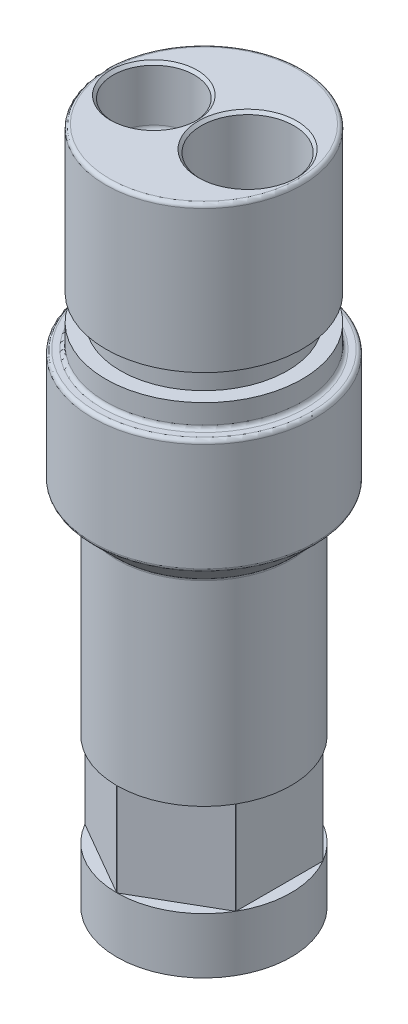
from build123d import *

# Parameters (mm, degrees)
CHAMFER1_SIZE      = 0.381
CUT_EXTRUDE3_START = -7.62
SKETCH6_OUTSIDE_W  = 52.928
SKETCH6_OUTSIDE_H  = 52.928
CUT_EXTRUDE3_DEPTH = 12.7


with BuildPart() as part:
    # Sketch1 → Revolve1 (revolve)
    with BuildSketch(Plane.XY, mode=Mode.PRIVATE) as revolve1_sk:
        with BuildLine():
            Line((-11.9126, 0.508), (-11.9126, 0))
            Line((-11.9126, 0), (-11.1506, 0))
            Line((-11.1506, 0), (-11.1506, 1.27))
            Line((-11.1506, 1.27), (-8.5852, 1.27))
            Line((-8.5852, 1.27), (-8.5852, 0))
            Line((-8.5852, 0), (-6.1341, 0))
            Line((-6.1341, 0), (-6.1341, 3.175))
            Line((-6.1341, 3.175), (-5.7531, 3.403927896))
            Line((-5.7531, 3.403927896), (-5.7531, 66.559453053))
            Line((-5.7531, 66.559453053), (0, 70.01626428))
            Line((0, 70.01626428), (0, 92.71))
            Line((0, 92.71), (-12.92225, 92.71))
            ThreePointArc((-12.92225, 92.71), (-13.281460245, 92.561210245), (-13.43025, 92.202))
            Line((-13.43025, 92.202), (-13.43025, 72.771))
            Line((-13.43025, 72.771), (-11.43, 72.771))
            Line((-11.43, 72.771), (-11.43, 69.215))
            Line((-11.43, 69.215), (-13.43025, 69.215))
            Line((-13.43025, 69.215), (-13.43025, 66.548))
            ThreePointArc((-13.43025, 66.548), (-13.579039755, 66.188789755), (-13.93825, 66.04))
            Line((-13.93825, 66.04), (-14.732, 66.04))
            ThreePointArc((-14.732, 66.04), (-15.091210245, 65.891210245), (-15.24, 65.532))
            Line((-15.24, 65.532), (-15.24, 50.8))
            ThreePointArc((-15.24, 50.8), (-15.201330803, 50.605596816), (-15.091210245, 50.440789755))
            Line((-15.091210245, 50.440789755), (-12.061389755, 47.410969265))
            ThreePointArc((-12.061389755, 47.410969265), (-11.951269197, 47.246162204), (-11.9126, 47.051759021))
            Line((-11.9126, 47.051759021), (-11.9126, 0.508))
        make_face()
    revolve(revolve1_sk.sketch.rotate(Axis((0, 0, 0), (0, -1, 0)), 270), axis=Axis((0, 0, 0), (0, -1, 0)))

    # Sketch2 → Cut-Revolve1 (revolve, cut)
    with BuildSketch(Plane.XY, mode=Mode.PRIVATE) as cut_revolve1_sk:
        with BuildLine():
            Line((-6.858, 92.71), (-6.858, 52.984611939))
            Line((-6.858, 52.984611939), (-4.1529, 54.61))
            Line((-4.1529, 54.61), (-4.1529, 84.455))
            Line((-4.1529, 84.455), (-2.0955, 84.455))
            ThreePointArc((-2.0955, 84.455), (-1.53872412, 84.68562412), (-1.3081, 85.2424))
            Line((-1.3081, 85.2424), (-1.3081, 92.71))
            Line((-1.3081, 92.71), (-6.858, 92.71))
        make_face()
    revolve(cut_revolve1_sk.sketch.rotate(Axis((-6.858, 92.71, 0), (0, -1, 0)), 180), axis=Axis((-6.858, 92.71, 0), (0, -1, 0)), mode=Mode.SUBTRACT)

    # Sketch4 → Cut-Revolve2 (revolve, cut)
    with BuildSketch(Plane.XY, mode=Mode.PRIVATE) as cut_revolve2_sk:
        with BuildLine():
            Line((5.969, 92.71), (12.319, 92.71))
            Line((12.319, 92.71), (12.319, 75.7174))
            ThreePointArc((12.319, 75.7174), (12.08837588, 75.16062412), (11.5316, 74.93))
            Line((11.5316, 74.93), (8.6741, 74.93))
            Line((8.6741, 74.93), (8.6741, 54.61))
            Line((8.6741, 54.61), (5.969, 52.984611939))
            Line((5.969, 52.984611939), (5.969, 92.71))
        make_face()
    revolve(cut_revolve2_sk.sketch.rotate(Axis((5.969, 92.71, 0), (0, -1, 0)), 180), axis=Axis((5.969, 92.71, 0), (0, -1, 0)), mode=Mode.SUBTRACT)

    # Chamfer1
    chamfer1_edges = [part.edges().sort_by_distance(p)[0] for p in [
        (-1.3081, 92.71, 0),
        (12.319, 92.71, 0),
    ]]
    chamfer(chamfer1_edges, length=CHAMFER1_SIZE)

    # Sketch6 outside → Cut-Extrude3 (cut)
    with BuildSketch(Plane.XZ.offset(CUT_EXTRUDE3_START)):
        Rectangle(SKETCH6_OUTSIDE_W, SKETCH6_OUTSIDE_H)
        Polygon((-10.3251, -5.961199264), (0, -11.922398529), (10.3251, -5.961199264), (10.3251, 5.961199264), (0, 11.922398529), (-10.3251, 5.961199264), align=None, mode=Mode.SUBTRACT)
    extrude(amount=-CUT_EXTRUDE3_DEPTH, mode=Mode.SUBTRACT)


solid = part.part
